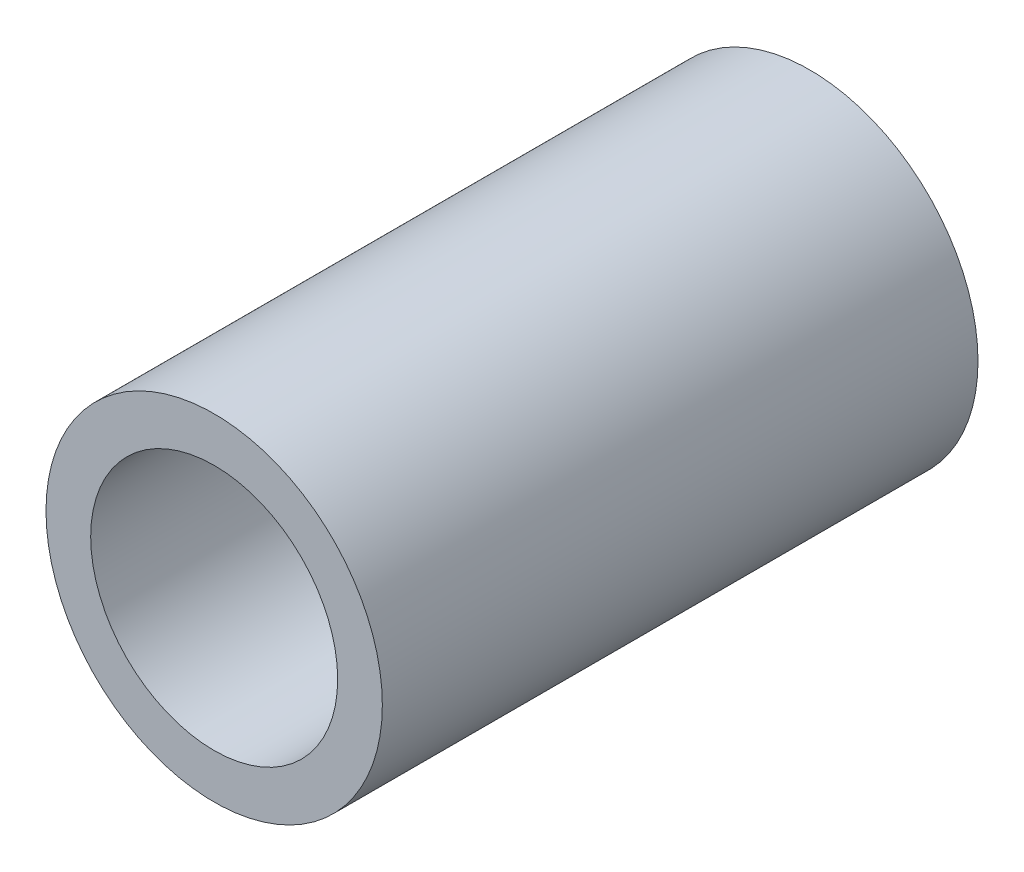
from build123d import *

# Parameters (mm, degrees)
SKETCH1_R           = 10.7569
SKETCH1_R_2         = 7.8994
BOSS_EXTRUDE1_DEPTH = 19.05


with BuildPart() as part:
    # Sketch1 → Boss-Extrude1 (new, symmetric)
    with BuildSketch(Plane.XY):
        with Locations(Location((0, 0, 0), (0, 0, 180))):
            Circle(SKETCH1_R)
        with Locations(Location((0, 0, 0), (0, 0, 180))):
            Circle(SKETCH1_R_2, mode=Mode.SUBTRACT)
    extrude(amount=BOSS_EXTRUDE1_DEPTH, both=True)


solid = part.part
